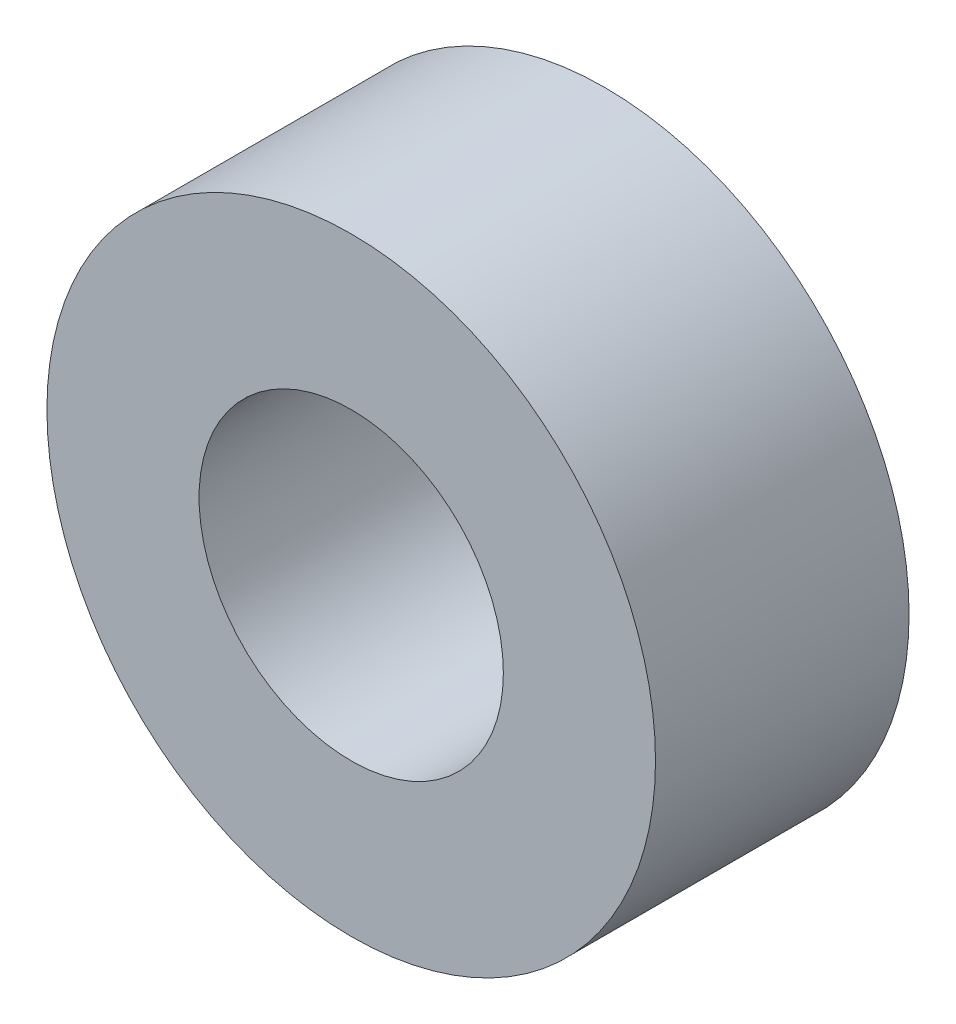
from build123d import *

# Parameters (mm, degrees)
SKETCH1_R           = 7.62
SKETCH1_R_2         = 3.81
BOSS_EXTRUDE1_DEPTH = 6.35


with BuildPart() as part:
    # Sketch1 → Boss-Extrude1 (new body)
    with BuildSketch(Plane.XY):
        Circle(SKETCH1_R)
        Circle(SKETCH1_R_2, mode=Mode.SUBTRACT)
    extrude(amount=BOSS_EXTRUDE1_DEPTH)


solid = part.part
